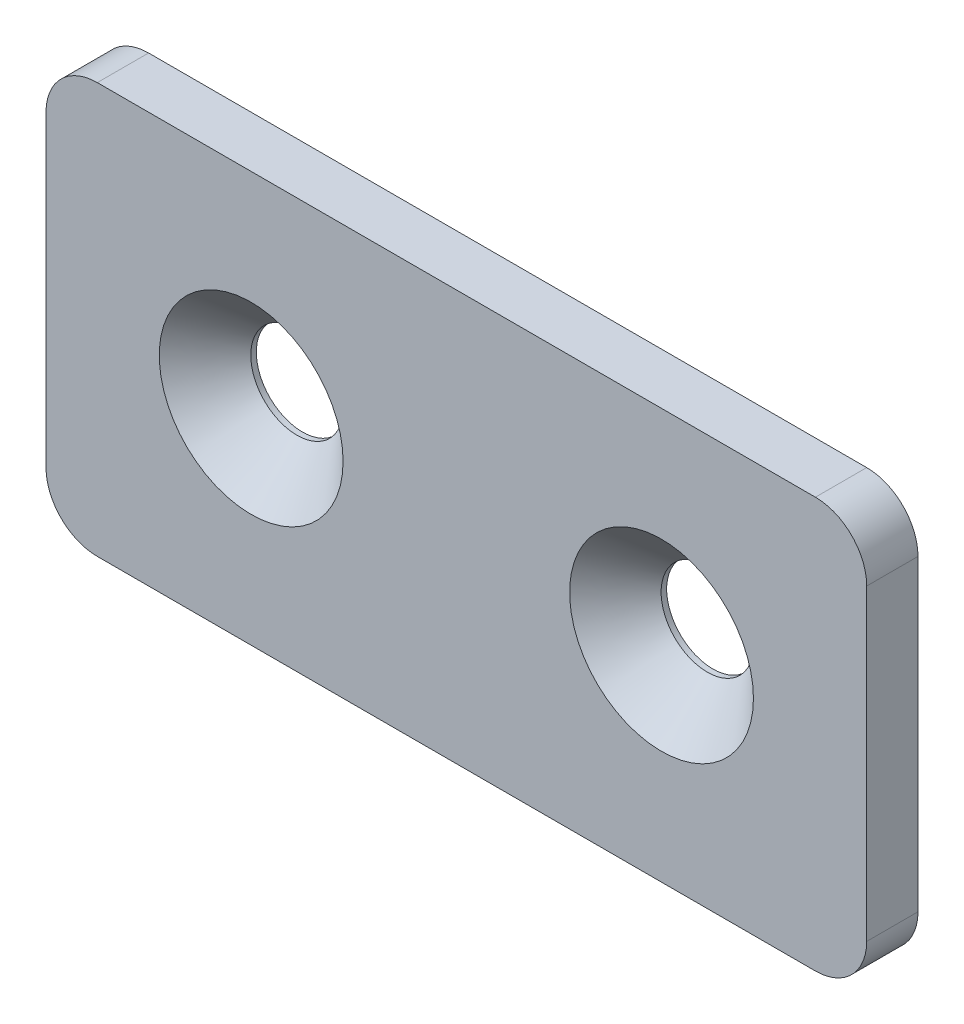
from build123d import *

# Parameters (mm, degrees)
CROQUIS1_W                                   = 80
CROQUIS1_H                                   = 40
EXTRUIR1_DEPTH                               = 5
REDONDEO1_R                                  = 5
REFRENTADO_PARA_TORNILLO_TAP_N_DE_CA_2_COUNT = 2
REFRENTADO_PARA_TORNILLO_TAP_N_DE_CA_2_PITCH = 40


with BuildPart() as part:
    # Croquis1 → Extruir1 (new body)
    with BuildSketch(Plane.XY):
        Rectangle(CROQUIS1_W, CROQUIS1_H)
    extrude(amount=EXTRUIR1_DEPTH)

    # Redondeo1
    redondeo1_edges = [part.edges().sort_by_distance(p)[0] for p in [
        (40, -20, 2.5),
        (-40, -20, 2.5),
        (-40, 20, 2.5),
        (40, 20, 2.5),
    ]]
    fillet(redondeo1_edges, radius=REDONDEO1_R)

    # Croquis4 → Refrentado para tornillo tap_n de cabeza (revolve, cut)
    with BuildSketch(Plane(origin=(-20, 0, 5), x_dir=(0, -1, 0), z_dir=(1, 0, 0))):
        Polygon((0, 0), (0, 5), (4.5, 5), (4.5, 4.46), (8.96, 0), align=None)
    refrentado_para_tornillo_tap_n_de_cabeza = revolve(axis=Axis((-20, 0, 11.35), (0, 0, -1)), mode=Mode.SUBTRACT)

    # Refrentado para tornillo tap_n de ca 2: Refrentado para tornillo tap_n de cabeza ×2
    with Locations(*[(i * REFRENTADO_PARA_TORNILLO_TAP_N_DE_CA_2_PITCH, 0, 0) for i in range(1, REFRENTADO_PARA_TORNILLO_TAP_N_DE_CA_2_COUNT)]):
        add(refrentado_para_tornillo_tap_n_de_cabeza, mode=Mode.SUBTRACT)


solid = part.part
